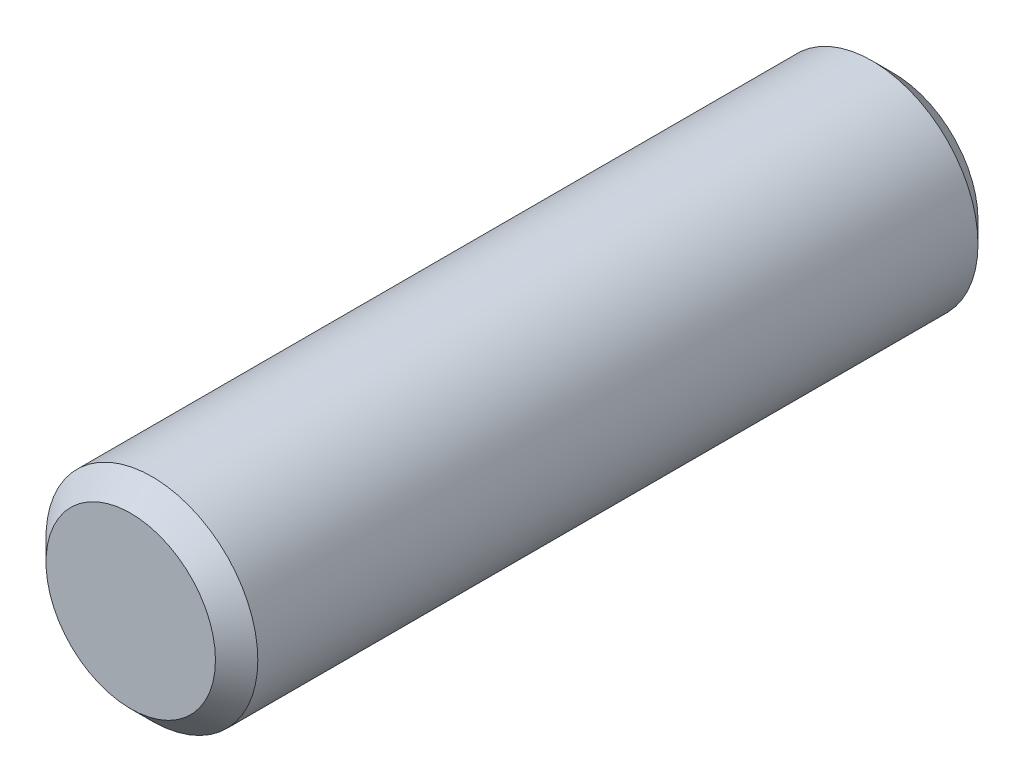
ISO-10303-21;
HEADER;
FILE_DESCRIPTION(('STEP AP214'),'2;1');
FILE_NAME('part.step','',(''),(''),'','','');
FILE_SCHEMA(('AUTOMOTIVE_DESIGN { 1 0 10303 214 1 1 1 1 }'));
ENDSEC;
DATA;
#1=APPLICATION_CONTEXT('core data for automotive mechanical design processes');
#2=APPLICATION_PROTOCOL_DEFINITION('international standard','automotive_design',2000,#1);
#3=PRODUCT_CONTEXT('',#1,'mechanical');
#4=PRODUCT('Part','Part','',(#3));
#5=PRODUCT_RELATED_PRODUCT_CATEGORY('part','',(#4));
#6=PRODUCT_DEFINITION_FORMATION('','',#4);
#7=PRODUCT_DEFINITION_CONTEXT('part definition',#1,'design');
#8=PRODUCT_DEFINITION('design','',#6,#7);
#9=PRODUCT_DEFINITION_SHAPE('','',#8);
#10=(LENGTH_UNIT() NAMED_UNIT(*) SI_UNIT(.MILLI.,.METRE.));
#11=(NAMED_UNIT(*) PLANE_ANGLE_UNIT() SI_UNIT($,.RADIAN.));
#12=(NAMED_UNIT(*) SI_UNIT($,.STERADIAN.) SOLID_ANGLE_UNIT());
#13=UNCERTAINTY_MEASURE_WITH_UNIT(LENGTH_MEASURE(1.E-05),#10,'distance_accuracy_value','');
#14=(GEOMETRIC_REPRESENTATION_CONTEXT(3) GLOBAL_UNCERTAINTY_ASSIGNED_CONTEXT((#13)) GLOBAL_UNIT_ASSIGNED_CONTEXT((#10,
#11,#12)) REPRESENTATION_CONTEXT('',''));
#15=CARTESIAN_POINT('',(0.,0.,0.));
#16=DIRECTION('',(0.,0.,1.));
#17=DIRECTION('',(1.,0.,0.));
#18=AXIS2_PLACEMENT_3D('',#15,#16,#17);
#19=CARTESIAN_POINT('',(0.,0.,18.));
#20=DIRECTION('',(0.,0.,-1.));
#21=DIRECTION('',(-1.,0.,0.));
#22=AXIS2_PLACEMENT_3D('',#19,#20,#21);
#23=CYLINDRICAL_SURFACE('',#22,2.5);
#24=CARTESIAN_POINT('',(0.,0.,0.500000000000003));
#25=DIRECTION('',(0.,0.,1.));
#26=DIRECTION('',(1.,0.,0.));
#27=AXIS2_PLACEMENT_3D('',#24,#25,#26);
#28=CIRCLE('',#27,2.5);
#29=CARTESIAN_POINT('',(2.5,0.,0.500000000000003));
#30=VERTEX_POINT('',#29);
#31=EDGE_CURVE('E39',#30,#30,#28,.T.);
#32=ORIENTED_EDGE('',*,*,#31,.T.);
#33=EDGE_LOOP('',(#32));
#34=FACE_BOUND('',#33,.T.);
#35=CARTESIAN_POINT('',(0.,0.,17.5));
#36=DIRECTION('',(0.,0.,1.));
#37=DIRECTION('',(1.,0.,0.));
#38=AXIS2_PLACEMENT_3D('',#35,#36,#37);
#39=CIRCLE('',#38,2.5);
#40=CARTESIAN_POINT('',(2.5,0.,17.5));
#41=VERTEX_POINT('',#40);
#42=EDGE_CURVE('E43',#41,#41,#39,.F.);
#43=ORIENTED_EDGE('',*,*,#42,.T.);
#44=EDGE_LOOP('',(#43));
#45=FACE_BOUND('',#44,.T.);
#46=ADVANCED_FACE('F29',(#34,#45),#23,.T.);
#47=CARTESIAN_POINT('',(0.,0.,18.));
#48=DIRECTION('',(0.,0.,1.));
#49=DIRECTION('',(1.,0.,0.));
#50=AXIS2_PLACEMENT_3D('',#47,#48,#49);
#51=PLANE('',#50);
#52=CARTESIAN_POINT('',(0.,0.,18.));
#53=DIRECTION('',(0.,0.,1.));
#54=DIRECTION('',(1.,0.,0.));
#55=AXIS2_PLACEMENT_3D('',#52,#53,#54);
#56=CIRCLE('',#55,1.99999999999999);
#57=CARTESIAN_POINT('',(1.99999999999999,0.,18.));
#58=VERTEX_POINT('',#57);
#59=EDGE_CURVE('E10',#58,#58,#56,.T.);
#60=ORIENTED_EDGE('',*,*,#59,.T.);
#61=EDGE_LOOP('',(#60));
#62=FACE_BOUND('',#61,.T.);
#63=ADVANCED_FACE('F62',(#62),#51,.T.);
#64=CARTESIAN_POINT('',(0.,0.,0.));
#65=DIRECTION('',(0.,0.,1.));
#66=DIRECTION('',(1.,0.,0.));
#67=AXIS2_PLACEMENT_3D('',#64,#65,#66);
#68=PLANE('',#67);
#69=CARTESIAN_POINT('',(0.,0.,0.));
#70=DIRECTION('',(0.,0.,1.));
#71=DIRECTION('',(1.,0.,0.));
#72=AXIS2_PLACEMENT_3D('',#69,#70,#71);
#73=CIRCLE('',#72,1.99999999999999);
#74=CARTESIAN_POINT('',(1.99999999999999,0.,0.));
#75=VERTEX_POINT('',#74);
#76=EDGE_CURVE('E35',#75,#75,#73,.F.);
#77=ORIENTED_EDGE('',*,*,#76,.T.);
#78=EDGE_LOOP('',(#77));
#79=FACE_BOUND('',#78,.T.);
#80=ADVANCED_FACE('F58',(#79),#68,.F.);
#81=CARTESIAN_POINT('',(0.,0.,0.500000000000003));
#82=DIRECTION('',(0.,0.,1.));
#83=DIRECTION('',(1.,0.,0.));
#84=AXIS2_PLACEMENT_3D('',#81,#82,#83);
#85=CONICAL_SURFACE('',#84,2.5,0.785398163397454);
#86=ORIENTED_EDGE('',*,*,#76,.F.);
#87=EDGE_LOOP('',(#86));
#88=FACE_BOUND('',#87,.T.);
#89=ORIENTED_EDGE('',*,*,#31,.F.);
#90=EDGE_LOOP('',(#89));
#91=FACE_BOUND('',#90,.T.);
#92=ADVANCED_FACE('F53',(#88,#91),#85,.T.);
#93=CARTESIAN_POINT('',(0.,0.,18.));
#94=DIRECTION('',(0.,0.,-1.));
#95=DIRECTION('',(-1.,0.,0.));
#96=AXIS2_PLACEMENT_3D('',#93,#94,#95);
#97=CONICAL_SURFACE('',#96,1.99999999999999,0.785398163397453);
#98=ORIENTED_EDGE('',*,*,#42,.F.);
#99=EDGE_LOOP('',(#98));
#100=FACE_BOUND('',#99,.T.);
#101=ORIENTED_EDGE('',*,*,#59,.F.);
#102=EDGE_LOOP('',(#101));
#103=FACE_BOUND('',#102,.T.);
#104=ADVANCED_FACE('F50',(#100,#103),#97,.T.);
#105=CLOSED_SHELL('',(#46,#63,#80,#92,#104));
#106=MANIFOLD_SOLID_BREP('B2',#105);
#107=ADVANCED_BREP_SHAPE_REPRESENTATION('',(#18,#106),#14);
#108=SHAPE_DEFINITION_REPRESENTATION(#9,#107);
ENDSEC;
END-ISO-10303-21;
